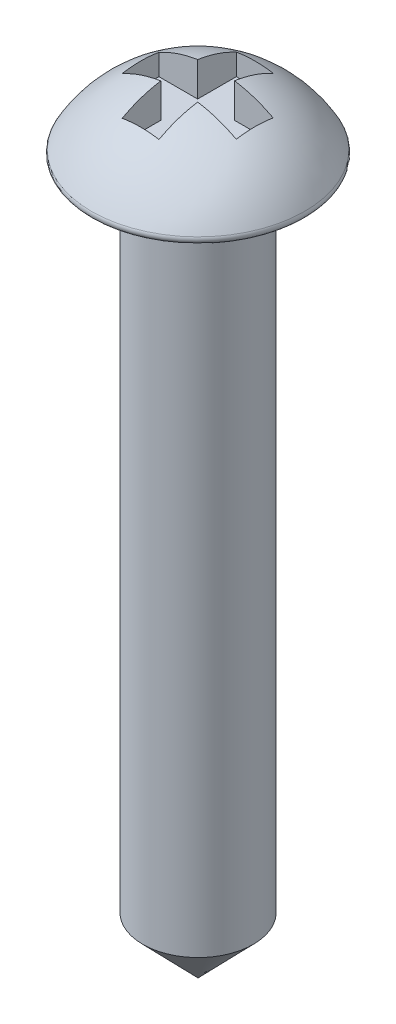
from build123d import *

# Parameters (mm, degrees)
CONG_1_R                = 0.1
ENL_V_MAT_EXTRU_1_DEPTH = 0.5


with BuildPart() as part:
    # Esquisse1 → R_volution1 (revolve)
    with BuildSketch(Plane.XY, mode=Mode.PRIVATE) as r_volution1_sk:
        with BuildLine():
            Line((2.2, 0), (1.1, 0))
            Line((1.1, 0), (1.1, -13))
            Line((1.1, -13), (0, -14.12930072))
            Line((0, -14.12930072), (0, 1.392961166))
            ThreePointArc((0, 1.392961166), (1.301954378, 1.015441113), (2.2, 0))
        make_face()
    revolve(r_volution1_sk.sketch.rotate(Axis((0, 3.800054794, 0), (0, -1, 0)), 90), axis=Axis((0, 3.800054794, 0), (0, -1, 0)))

    # Cong_1
    cong_1_edges = [part.edges().sort_by_distance(p)[0] for p in [
        (0, 0, -2.2),
    ]]
    fillet(cong_1_edges, radius=CONG_1_R)

    # Esquisse2 → Enl_v. mat.-Extru.1 (cut, symmetric)
    with BuildSketch(Plane(origin=(0, 1.15653742, 0), x_dir=(-1, 0, 0), z_dir=(0, 1, 0))):
        Polygon((-0.361948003, 1.140760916), (0.37159995, 1.140760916), (0.37159995, 0.37038863), (1.141972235, 0.37038863), (1.141972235, -0.363159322), (0.37159995, -0.363159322), (0.37159995, -1.133531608), (-0.361948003, -1.133531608), (-0.361948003, -0.363159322), (-1.132320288, -0.363159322), (-1.132320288, 0.37038863), (-0.361948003, 0.37038863), align=None)
    extrude(amount=ENL_V_MAT_EXTRU_1_DEPTH, both=True, mode=Mode.SUBTRACT)


solid = part.part
